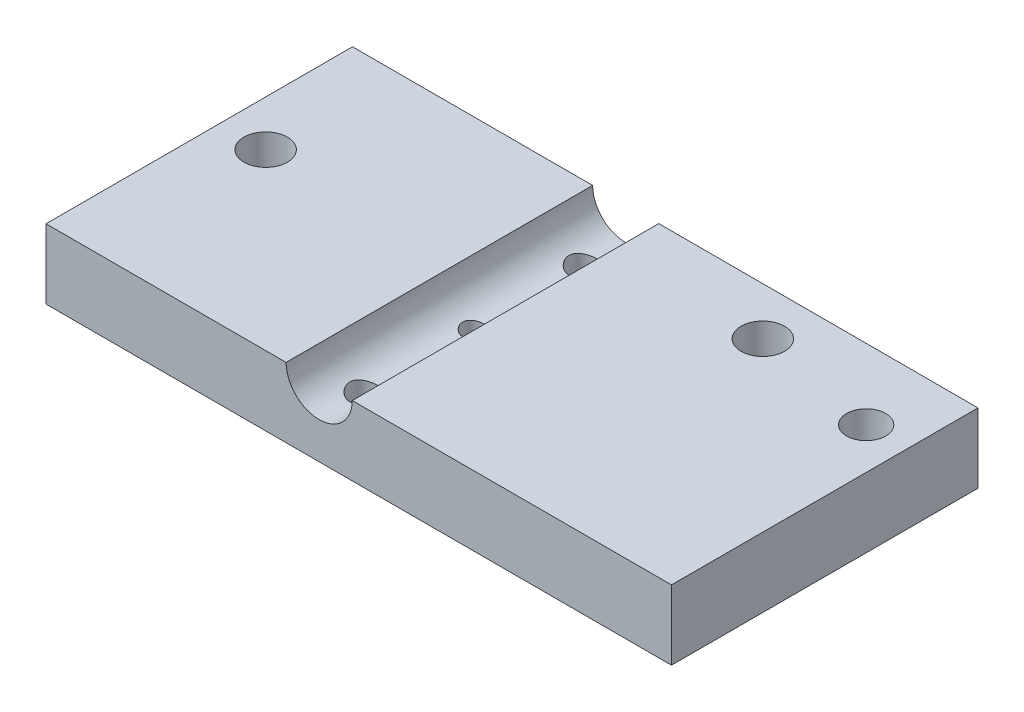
from build123d import *

# Parameters (mm, degrees)
SKETCH1_W           = 143.8
SKETCH1_H           = 16
BOSS_EXTRUDE1_DEPTH = 70.47
SKETCH2_R           = 3.25
CUT_EXTRUDE1_DEPTH  = 102.939349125
SKETCH4_R           = 7.6
CUT_EXTRUDE2_DEPTH  = 101.99322205
SKETCH5_R           = 2.5
CUT_EXTRUDE3_DEPTH  = 102.93934921
SKETCH6_R           = 4.5
CUT_EXTRUDE4_DEPTH  = 102.93934921
CUT_EXTRUDE4_DRAFT  = -2.27
SKETCH7_R           = 5
CUT_EXTRUDE5_DEPTH  = 102.93934921
SKETCH8_R           = 5
CUT_EXTRUDE6_DEPTH  = 102.93934921


with BuildPart() as part:
    # Sketch1 → Boss-Extrude1 (new body)
    with BuildSketch(Plane.XY):
        Rectangle(SKETCH1_W, SKETCH1_H)
    extrude(amount=BOSS_EXTRUDE1_DEPTH)

    # Sketch2 → Cut-Extrude1 (cut, through all)
    with BuildSketch(Plane.XZ.offset(8)):
        with Locations(Location((-9.1, 60.17, 0), (0, 0, 270))):
            Circle(SKETCH2_R)
        with Locations(Location((-9.1, 9.77, 0), (0, 0, 270))):
            Circle(SKETCH2_R)
    extrude(amount=-CUT_EXTRUDE1_DEPTH, mode=Mode.SUBTRACT)

    # Sketch4 → Cut-Extrude2 (cut, through all)
    with BuildSketch(Plane.XY.offset(70.47)):
        with Locations((-9.1, 8)):
            Circle(SKETCH4_R)
    extrude(amount=-CUT_EXTRUDE2_DEPTH, mode=Mode.SUBTRACT)

    # Sketch5 → Cut-Extrude3 (cut, through all)
    with BuildSketch(Plane(origin=(0, 8, 0), x_dir=(1, 0, 0), z_dir=(0, 1, 0))):
        with Locations(Location((-9.1, -34.97, 0), (0, 0, 270))):
            Circle(SKETCH5_R)
    extrude(amount=-CUT_EXTRUDE3_DEPTH, mode=Mode.SUBTRACT)


with BuildPart() as cut_extrude4_tool:
    # Sketch6 → Cut-Extrude4 (with draft: the straight prism first)
    with BuildSketch(Plane(origin=(0, 8, 0), x_dir=(1, 0, 0), z_dir=(0, 1, 0))):
        with Locations((62.4, -16.21)):
            Circle(SKETCH6_R)
    extrude(amount=-CUT_EXTRUDE4_DEPTH)
    # Cut-Extrude4: the draft: its side faces are tilted about the plane it starts from
    cut_extrude4_sides = [cut_extrude4_tool.faces().sort_by_distance(p)[0] for p in [
        (57.9, -43.469674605, 16.21),
    ]]
    draft(cut_extrude4_sides, Plane(origin=(0, 8, 0), x_dir=(1, 0, 0), z_dir=(0, 1, 0)), CUT_EXTRUDE4_DRAFT)


with BuildPart() as part_1:
    add(part.part)

    # Cut-Extrude4: cut by cut_extrude4_tool
    add(cut_extrude4_tool.part, mode=Mode.SUBTRACT)

    # Sketch7 → Cut-Extrude5 (cut, through all)
    with BuildSketch(Plane(origin=(0, 8, 0), x_dir=(1, 0, 0), z_dir=(0, 1, 0))):
        with Locations(Location((-61.4, -30.47, 0), (0, 0, 270))):
            Circle(SKETCH7_R)
    extrude(amount=-CUT_EXTRUDE5_DEPTH, mode=Mode.SUBTRACT)

    # Sketch8 → Cut-Extrude6 (cut, through all)
    with BuildSketch(Plane(origin=(0, 8, 0), x_dir=(1, 0, 0), z_dir=(0, 1, 0))):
        with Locations(Location((33.4, -10.97, 0), (0, 0, 270))):
            Circle(SKETCH8_R)
    extrude(amount=-CUT_EXTRUDE6_DEPTH, mode=Mode.SUBTRACT)


solid = part_1.part
